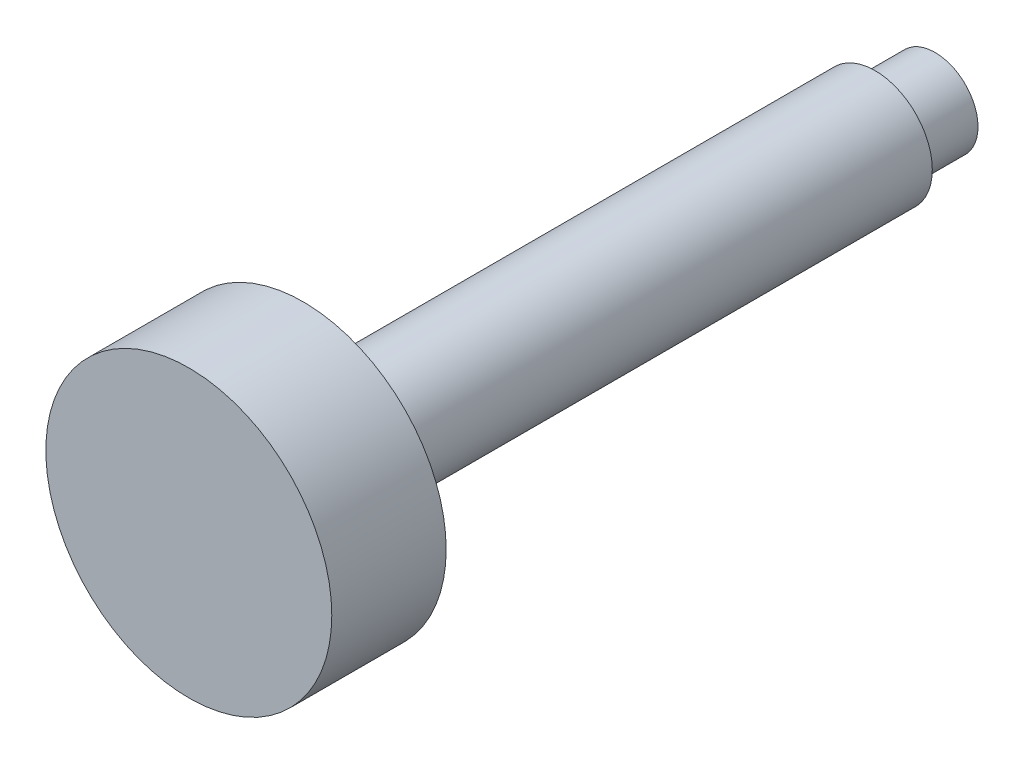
ISO-10303-21;
HEADER;
FILE_DESCRIPTION(('STEP AP214'),'2;1');
FILE_NAME('part.step','',(''),(''),'','','');
FILE_SCHEMA(('AUTOMOTIVE_DESIGN { 1 0 10303 214 1 1 1 1 }'));
ENDSEC;
DATA;
#1=APPLICATION_CONTEXT('core data for automotive mechanical design processes');
#2=APPLICATION_PROTOCOL_DEFINITION('international standard','automotive_design',2000,#1);
#3=PRODUCT_CONTEXT('',#1,'mechanical');
#4=PRODUCT('Part','Part','',(#3));
#5=PRODUCT_RELATED_PRODUCT_CATEGORY('part','',(#4));
#6=PRODUCT_DEFINITION_FORMATION('','',#4);
#7=PRODUCT_DEFINITION_CONTEXT('part definition',#1,'design');
#8=PRODUCT_DEFINITION('design','',#6,#7);
#9=PRODUCT_DEFINITION_SHAPE('','',#8);
#10=(LENGTH_UNIT() NAMED_UNIT(*) SI_UNIT(.MILLI.,.METRE.));
#11=(NAMED_UNIT(*) PLANE_ANGLE_UNIT() SI_UNIT($,.RADIAN.));
#12=(NAMED_UNIT(*) SI_UNIT($,.STERADIAN.) SOLID_ANGLE_UNIT());
#13=UNCERTAINTY_MEASURE_WITH_UNIT(LENGTH_MEASURE(1.E-05),#10,'distance_accuracy_value','');
#14=(GEOMETRIC_REPRESENTATION_CONTEXT(3) GLOBAL_UNCERTAINTY_ASSIGNED_CONTEXT((#13)) GLOBAL_UNIT_ASSIGNED_CONTEXT((#10,
#11,#12)) REPRESENTATION_CONTEXT('',''));
#15=CARTESIAN_POINT('',(0.,0.,0.));
#16=DIRECTION('',(0.,0.,1.));
#17=DIRECTION('',(1.,0.,0.));
#18=AXIS2_PLACEMENT_3D('',#15,#16,#17);
#19=CARTESIAN_POINT('',(0.,0.,6.));
#20=DIRECTION('',(0.,0.,1.));
#21=DIRECTION('',(1.,0.,0.));
#22=AXIS2_PLACEMENT_3D('',#19,#20,#21);
#23=SPHERICAL_SURFACE('',#22,6.);
#24=CARTESIAN_POINT('',(0.,0.,0.803847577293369));
#25=DIRECTION('',(0.,0.,1.));
#26=DIRECTION('',(1.,0.,0.));
#27=AXIS2_PLACEMENT_3D('',#24,#25,#26);
#28=CIRCLE('',#27,3.);
#29=CARTESIAN_POINT('',(3.,0.,0.803847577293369));
#30=VERTEX_POINT('',#29);
#31=EDGE_CURVE('E8',#30,#30,#28,.T.);
#32=ORIENTED_EDGE('',*,*,#31,.F.);
#33=EDGE_LOOP('',(#32));
#34=FACE_BOUND('',#33,.T.);
#35=ADVANCED_FACE('F12',(#34),#23,.T.);
#36=CARTESIAN_POINT('',(0.,0.,40.017563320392));
#37=DIRECTION('',(0.,0.,1.));
#38=DIRECTION('',(1.,0.,0.));
#39=AXIS2_PLACEMENT_3D('',#36,#37,#38);
#40=CYLINDRICAL_SURFACE('',#39,3.);
#41=CARTESIAN_POINT('',(0.,0.,5.));
#42=DIRECTION('',(0.,0.,1.));
#43=DIRECTION('',(1.,0.,0.));
#44=AXIS2_PLACEMENT_3D('',#41,#42,#43);
#45=CIRCLE('',#44,3.);
#46=CARTESIAN_POINT('',(3.,0.,5.));
#47=VERTEX_POINT('',#46);
#48=EDGE_CURVE('E18',#47,#47,#45,.T.);
#49=ORIENTED_EDGE('',*,*,#48,.F.);
#50=EDGE_LOOP('',(#49));
#51=FACE_BOUND('',#50,.T.);
#52=ORIENTED_EDGE('',*,*,#31,.T.);
#53=EDGE_LOOP('',(#52));
#54=FACE_BOUND('',#53,.T.);
#55=ADVANCED_FACE('F60',(#51,#54),#40,.T.);
#56=CARTESIAN_POINT('',(-3.,0.,5.));
#57=DIRECTION('',(0.,0.,1.));
#58=DIRECTION('',(1.,0.,0.));
#59=AXIS2_PLACEMENT_3D('',#56,#57,#58);
#60=PLANE('',#59);
#61=CARTESIAN_POINT('',(0.,0.,5.));
#62=DIRECTION('',(0.,0.,1.));
#63=DIRECTION('',(1.,0.,0.));
#64=AXIS2_PLACEMENT_3D('',#61,#62,#63);
#65=CIRCLE('',#64,4.);
#66=CARTESIAN_POINT('',(4.,0.,5.));
#67=VERTEX_POINT('',#66);
#68=EDGE_CURVE('E22',#67,#67,#65,.T.);
#69=ORIENTED_EDGE('',*,*,#68,.F.);
#70=EDGE_LOOP('',(#69));
#71=FACE_BOUND('',#70,.T.);
#72=ORIENTED_EDGE('',*,*,#48,.T.);
#73=EDGE_LOOP('',(#72));
#74=FACE_BOUND('',#73,.T.);
#75=ADVANCED_FACE('F55',(#71,#74),#60,.F.);
#76=CARTESIAN_POINT('',(0.,0.,40.017563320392));
#77=DIRECTION('',(0.,0.,1.));
#78=DIRECTION('',(1.,0.,0.));
#79=AXIS2_PLACEMENT_3D('',#76,#77,#78);
#80=CYLINDRICAL_SURFACE('',#79,4.);
#81=CARTESIAN_POINT('',(0.,0.,45.));
#82=DIRECTION('',(0.,0.,1.));
#83=DIRECTION('',(1.,0.,0.));
#84=AXIS2_PLACEMENT_3D('',#81,#82,#83);
#85=CIRCLE('',#84,4.);
#86=CARTESIAN_POINT('',(4.,0.,45.));
#87=VERTEX_POINT('',#86);
#88=EDGE_CURVE('E26',#87,#87,#85,.T.);
#89=ORIENTED_EDGE('',*,*,#88,.F.);
#90=EDGE_LOOP('',(#89));
#91=FACE_BOUND('',#90,.T.);
#92=ORIENTED_EDGE('',*,*,#68,.T.);
#93=EDGE_LOOP('',(#92));
#94=FACE_BOUND('',#93,.T.);
#95=ADVANCED_FACE('F49',(#91,#94),#80,.T.);
#96=CARTESIAN_POINT('',(-4.,0.,45.));
#97=DIRECTION('',(0.,0.,1.));
#98=DIRECTION('',(1.,0.,0.));
#99=AXIS2_PLACEMENT_3D('',#96,#97,#98);
#100=PLANE('',#99);
#101=CARTESIAN_POINT('',(0.,0.,45.));
#102=DIRECTION('',(0.,0.,1.));
#103=DIRECTION('',(1.,0.,0.));
#104=AXIS2_PLACEMENT_3D('',#101,#102,#103);
#105=CIRCLE('',#104,10.);
#106=CARTESIAN_POINT('',(10.,0.,45.));
#107=VERTEX_POINT('',#106);
#108=EDGE_CURVE('E31',#107,#107,#105,.T.);
#109=ORIENTED_EDGE('',*,*,#108,.F.);
#110=EDGE_LOOP('',(#109));
#111=FACE_BOUND('',#110,.T.);
#112=ORIENTED_EDGE('',*,*,#88,.T.);
#113=EDGE_LOOP('',(#112));
#114=FACE_BOUND('',#113,.T.);
#115=ADVANCED_FACE('F43',(#111,#114),#100,.F.);
#116=CARTESIAN_POINT('',(0.,0.,40.017563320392));
#117=DIRECTION('',(0.,0.,1.));
#118=DIRECTION('',(1.,0.,0.));
#119=AXIS2_PLACEMENT_3D('',#116,#117,#118);
#120=CYLINDRICAL_SURFACE('',#119,10.);
#121=CARTESIAN_POINT('',(0.,0.,53.));
#122=DIRECTION('',(0.,0.,1.));
#123=DIRECTION('',(1.,0.,0.));
#124=AXIS2_PLACEMENT_3D('',#121,#122,#123);
#125=CIRCLE('',#124,10.);
#126=CARTESIAN_POINT('',(10.,0.,53.));
#127=VERTEX_POINT('',#126);
#128=EDGE_CURVE('E34',#127,#127,#125,.T.);
#129=ORIENTED_EDGE('',*,*,#128,.F.);
#130=EDGE_LOOP('',(#129));
#131=FACE_BOUND('',#130,.T.);
#132=ORIENTED_EDGE('',*,*,#108,.T.);
#133=EDGE_LOOP('',(#132));
#134=FACE_BOUND('',#133,.T.);
#135=ADVANCED_FACE('F40',(#131,#134),#120,.T.);
#136=CARTESIAN_POINT('',(-10.,0.,53.));
#137=DIRECTION('',(0.,0.,-1.));
#138=DIRECTION('',(-1.,0.,0.));
#139=AXIS2_PLACEMENT_3D('',#136,#137,#138);
#140=PLANE('',#139);
#141=ORIENTED_EDGE('',*,*,#128,.T.);
#142=EDGE_LOOP('',(#141));
#143=FACE_BOUND('',#142,.T.);
#144=ADVANCED_FACE('F38',(#143),#140,.F.);
#145=CLOSED_SHELL('',(#35,#55,#75,#95,#115,#135,#144));
#146=MANIFOLD_SOLID_BREP('B1',#145);
#147=ADVANCED_BREP_SHAPE_REPRESENTATION('',(#18,#146),#14);
#148=SHAPE_DEFINITION_REPRESENTATION(#9,#147);
ENDSEC;
END-ISO-10303-21;
